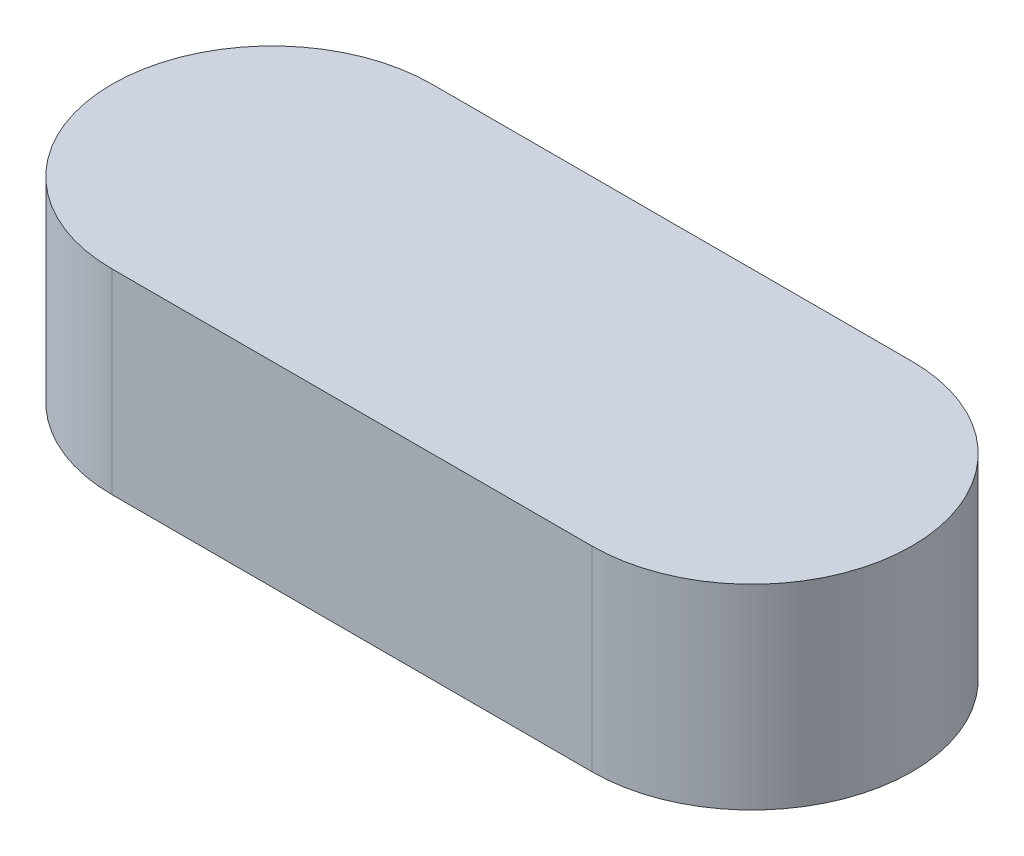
from build123d import *

# Parameters (mm, degrees)
EXTRUDE1_DEPTH = 11


with BuildPart() as part:
    # Sketch1 → Extrude1 (new body)
    with BuildSketch(Plane(origin=(0, 0, 0), x_dir=(1, 0, 0), z_dir=(0, 1, 0))):
        with BuildLine():
            Line((27, 9), (0, 9))
            ThreePointArc((0, 9), (-9, 0), (0, -9))
            Line((0, -9), (27, -9))
            ThreePointArc((27, -9), (36, 0), (27, 9))
        make_face()
    extrude(amount=EXTRUDE1_DEPTH)


solid = part.part
